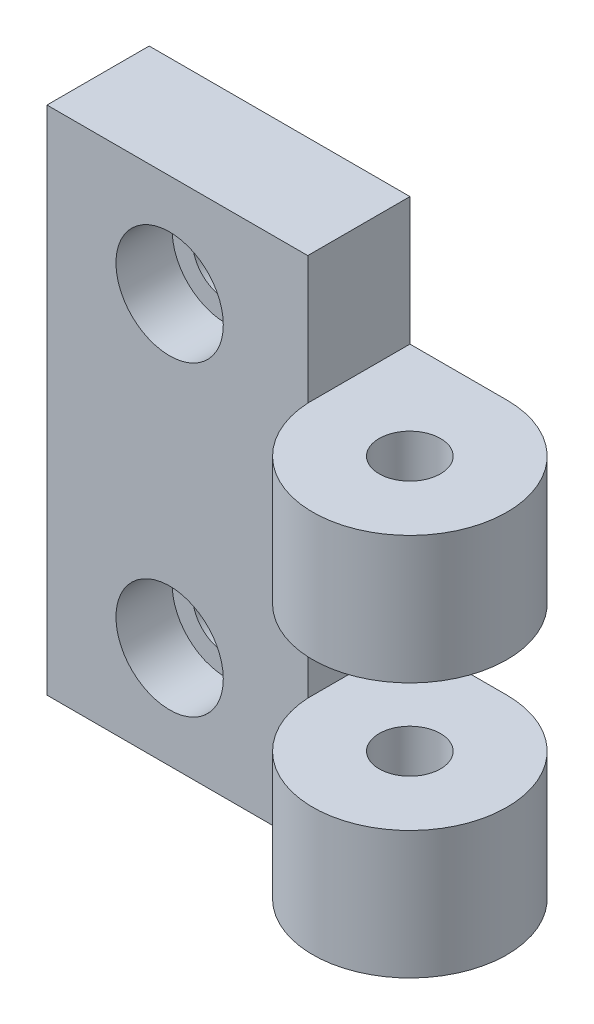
ISO-10303-21;
HEADER;
FILE_DESCRIPTION(('STEP AP214'),'2;1');
FILE_NAME('part.step','',(''),(''),'','','');
FILE_SCHEMA(('AUTOMOTIVE_DESIGN { 1 0 10303 214 1 1 1 1 }'));
ENDSEC;
DATA;
#1=APPLICATION_CONTEXT('core data for automotive mechanical design processes');
#2=APPLICATION_PROTOCOL_DEFINITION('international standard','automotive_design',2000,#1);
#3=PRODUCT_CONTEXT('',#1,'mechanical');
#4=PRODUCT('Part','Part','',(#3));
#5=PRODUCT_RELATED_PRODUCT_CATEGORY('part','',(#4));
#6=PRODUCT_DEFINITION_FORMATION('','',#4);
#7=PRODUCT_DEFINITION_CONTEXT('part definition',#1,'design');
#8=PRODUCT_DEFINITION('design','',#6,#7);
#9=PRODUCT_DEFINITION_SHAPE('','',#8);
#10=(LENGTH_UNIT() NAMED_UNIT(*) SI_UNIT(.MILLI.,.METRE.));
#11=(NAMED_UNIT(*) PLANE_ANGLE_UNIT() SI_UNIT($,.RADIAN.));
#12=(NAMED_UNIT(*) SI_UNIT($,.STERADIAN.) SOLID_ANGLE_UNIT());
#13=UNCERTAINTY_MEASURE_WITH_UNIT(LENGTH_MEASURE(1.E-05),#10,'distance_accuracy_value','');
#14=(GEOMETRIC_REPRESENTATION_CONTEXT(3) GLOBAL_UNCERTAINTY_ASSIGNED_CONTEXT((#13)) GLOBAL_UNIT_ASSIGNED_CONTEXT((#10,
#11,#12)) REPRESENTATION_CONTEXT('',''));
#15=CARTESIAN_POINT('',(0.,0.,0.));
#16=DIRECTION('',(0.,0.,1.));
#17=DIRECTION('',(1.,0.,0.));
#18=AXIS2_PLACEMENT_3D('',#15,#16,#17);
#19=CARTESIAN_POINT('',(35.0000000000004,50.,-0.499999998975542));
#20=DIRECTION('',(0.,-1.,0.));
#21=DIRECTION('',(0.,0.,-1.00000000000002));
#22=AXIS2_PLACEMENT_3D('',#19,#20,#21);
#23=CYLINDRICAL_SURFACE('',#22,9.5);
#24=CARTESIAN_POINT('',(34.9999999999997,12.5,-0.499999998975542));
#25=DIRECTION('',(0.,-1.,0.));
#26=DIRECTION('',(1.00000000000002,0.,0.));
#27=AXIS2_PLACEMENT_3D('',#24,#25,#26);
#28=CIRCLE('',#27,9.5);
#29=CARTESIAN_POINT('',(34.9999999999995,12.5,-9.9999999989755));
#30=VERTEX_POINT('',#29);
#31=CARTESIAN_POINT('',(25.5131670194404,12.5,1.11022302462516E-13));
#32=VERTEX_POINT('',#31);
#33=EDGE_CURVE('E136',#30,#32,#28,.T.);
#34=ORIENTED_EDGE('',*,*,#33,.T.);
#35=DIRECTION('',(0.,-1.,0.));
#36=VECTOR('',#35,1.);
#37=CARTESIAN_POINT('',(25.5131670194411,49.9999999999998,-1.11022302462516E-13));
#38=LINE('',#37,#36);
#39=CARTESIAN_POINT('',(25.5131670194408,-2.22044604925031E-13,0.));
#40=VERTEX_POINT('',#39);
#41=EDGE_CURVE('E133',#32,#40,#38,.T.);
#42=ORIENTED_EDGE('',*,*,#41,.T.);
#43=CARTESIAN_POINT('',(34.9999999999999,-2.22044604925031E-13,-0.499999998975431));
#44=DIRECTION('',(0.,1.,0.));
#45=DIRECTION('',(0.,0.,1.00000000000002));
#46=AXIS2_PLACEMENT_3D('',#43,#44,#45);
#47=CIRCLE('',#46,9.5);
#48=CARTESIAN_POINT('',(34.9999999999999,-2.22044604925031E-13,-9.99999999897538));
#49=VERTEX_POINT('',#48);
#50=EDGE_CURVE('E200',#40,#49,#47,.T.);
#51=ORIENTED_EDGE('',*,*,#50,.T.);
#52=DIRECTION('',(0.,-1.,0.));
#53=VECTOR('',#52,1.);
#54=CARTESIAN_POINT('',(35.0000000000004,50.,-9.9999999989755));
#55=LINE('',#54,#53);
#56=EDGE_CURVE('E219',#30,#49,#55,.T.);
#57=ORIENTED_EDGE('',*,*,#56,.F.);
#58=EDGE_LOOP('',(#34,#42,#51,#57));
#59=FACE_BOUND('',#58,.T.);
#60=ADVANCED_FACE('F36',(#59),#23,.T.);
#61=CARTESIAN_POINT('',(35.0000000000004,50.,-0.499999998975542));
#62=DIRECTION('',(0.,-1.,0.));
#63=DIRECTION('',(0.,0.,-1.00000000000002));
#64=AXIS2_PLACEMENT_3D('',#61,#62,#63);
#65=CYLINDRICAL_SURFACE('',#64,3.);
#66=CARTESIAN_POINT('',(34.9999999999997,12.5,-0.499999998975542));
#67=DIRECTION('',(0.,-1.,0.));
#68=DIRECTION('',(1.00000000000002,0.,0.));
#69=AXIS2_PLACEMENT_3D('',#66,#67,#68);
#70=CIRCLE('',#69,3.);
#71=CARTESIAN_POINT('',(37.9999999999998,12.5,-0.499999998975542));
#72=VERTEX_POINT('',#71);
#73=EDGE_CURVE('E113',#72,#72,#70,.T.);
#74=ORIENTED_EDGE('',*,*,#73,.F.);
#75=EDGE_LOOP('',(#74));
#76=FACE_BOUND('',#75,.T.);
#77=CARTESIAN_POINT('',(34.9999999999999,-2.22044604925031E-13,-0.499999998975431));
#78=DIRECTION('',(0.,1.,0.));
#79=DIRECTION('',(0.,0.,1.00000000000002));
#80=AXIS2_PLACEMENT_3D('',#77,#78,#79);
#81=CIRCLE('',#80,3.);
#82=CARTESIAN_POINT('',(34.9999999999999,-2.22044604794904E-13,2.50000000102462));
#83=VERTEX_POINT('',#82);
#84=EDGE_CURVE('E189',#83,#83,#81,.T.);
#85=ORIENTED_EDGE('',*,*,#84,.F.);
#86=EDGE_LOOP('',(#85));
#87=FACE_BOUND('',#86,.T.);
#88=ADVANCED_FACE('F245',(#76,#87),#65,.F.);
#89=CARTESIAN_POINT('',(35.0000000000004,50.,-0.499999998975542));
#90=DIRECTION('',(0.,1.,0.));
#91=DIRECTION('',(0.,0.,1.00000000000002));
#92=AXIS2_PLACEMENT_3D('',#89,#90,#91);
#93=PLANE('',#92);
#94=DIRECTION('',(0.,0.,1.00000000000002));
#95=VECTOR('',#94,1.);
#96=CARTESIAN_POINT('',(25.5131670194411,49.9999999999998,-25.0000000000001));
#97=LINE('',#96,#95);
#98=CARTESIAN_POINT('',(25.5131670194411,49.9999999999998,-9.9999999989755));
#99=VERTEX_POINT('',#98);
#100=CARTESIAN_POINT('',(25.5131670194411,49.9999999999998,-1.11022302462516E-13));
#101=VERTEX_POINT('',#100);
#102=EDGE_CURVE('E135',#99,#101,#97,.T.);
#103=ORIENTED_EDGE('',*,*,#102,.F.);
#104=DIRECTION('',(-1.00000000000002,0.,0.));
#105=VECTOR('',#104,1.);
#106=CARTESIAN_POINT('',(2.22044604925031E-13,50.,-9.9999999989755));
#107=LINE('',#106,#105);
#108=CARTESIAN_POINT('',(2.22044604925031E-13,50.,-9.9999999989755));
#109=VERTEX_POINT('',#108);
#110=EDGE_CURVE('E214',#99,#109,#107,.T.);
#111=ORIENTED_EDGE('',*,*,#110,.T.);
#112=DIRECTION('',(0.,0.,1.00000000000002));
#113=VECTOR('',#112,1.);
#114=CARTESIAN_POINT('',(2.22044604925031E-13,50.,-1.11022302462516E-13));
#115=LINE('',#114,#113);
#116=CARTESIAN_POINT('',(2.22044604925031E-13,50.,-1.11022302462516E-13));
#117=VERTEX_POINT('',#116);
#118=EDGE_CURVE('E206',#109,#117,#115,.T.);
#119=ORIENTED_EDGE('',*,*,#118,.T.);
#120=DIRECTION('',(1.00000000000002,0.,0.));
#121=VECTOR('',#120,1.);
#122=CARTESIAN_POINT('',(2.22044604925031E-13,50.,-1.11022302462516E-13));
#123=LINE('',#122,#121);
#124=EDGE_CURVE('E210',#117,#101,#123,.T.);
#125=ORIENTED_EDGE('',*,*,#124,.T.);
#126=EDGE_LOOP('',(#103,#111,#119,#125));
#127=FACE_BOUND('',#126,.T.);
#128=ADVANCED_FACE('F251',(#127),#93,.T.);
#129=CARTESIAN_POINT('',(34.9999999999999,-2.22044604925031E-13,-0.499999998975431));
#130=DIRECTION('',(0.,1.,0.));
#131=DIRECTION('',(0.,0.,1.00000000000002));
#132=AXIS2_PLACEMENT_3D('',#129,#130,#131);
#133=PLANE('',#132);
#134=DIRECTION('',(0.,0.,1.00000000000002));
#135=VECTOR('',#134,1.);
#136=CARTESIAN_POINT('',(0.,0.,0.));
#137=LINE('',#136,#135);
#138=CARTESIAN_POINT('',(0.,0.,-9.99999999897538));
#139=VERTEX_POINT('',#138);
#140=CARTESIAN_POINT('',(0.,0.,0.));
#141=VERTEX_POINT('',#140);
#142=EDGE_CURVE('E193',#139,#141,#137,.T.);
#143=ORIENTED_EDGE('',*,*,#142,.F.);
#144=DIRECTION('',(-1.00000000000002,0.,0.));
#145=VECTOR('',#144,1.);
#146=CARTESIAN_POINT('',(0.,0.,-9.99999999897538));
#147=LINE('',#146,#145);
#148=EDGE_CURVE('E204',#49,#139,#147,.T.);
#149=ORIENTED_EDGE('',*,*,#148,.F.);
#150=ORIENTED_EDGE('',*,*,#50,.F.);
#151=DIRECTION('',(1.00000000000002,0.,0.));
#152=VECTOR('',#151,1.);
#153=CARTESIAN_POINT('',(0.,0.,0.));
#154=LINE('',#153,#152);
#155=EDGE_CURVE('E197',#141,#40,#154,.T.);
#156=ORIENTED_EDGE('',*,*,#155,.F.);
#157=EDGE_LOOP('',(#143,#149,#150,#156));
#158=FACE_BOUND('',#157,.T.);
#159=ORIENTED_EDGE('',*,*,#84,.T.);
#160=EDGE_LOOP('',(#159));
#161=FACE_BOUND('',#160,.T.);
#162=ADVANCED_FACE('F265',(#158,#161),#133,.F.);
#163=CARTESIAN_POINT('',(2.22044604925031E-13,50.,-1.11022302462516E-13));
#164=DIRECTION('',(1.00000000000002,0.,0.));
#165=DIRECTION('',(0.,0.,-1.00000000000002));
#166=AXIS2_PLACEMENT_3D('',#163,#164,#165);
#167=PLANE('',#166);
#168=ORIENTED_EDGE('',*,*,#142,.T.);
#169=DIRECTION('',(0.,-1.,0.));
#170=VECTOR('',#169,1.);
#171=CARTESIAN_POINT('',(2.22044604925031E-13,50.,-1.11022302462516E-13));
#172=LINE('',#171,#170);
#173=EDGE_CURVE('E146',#117,#141,#172,.T.);
#174=ORIENTED_EDGE('',*,*,#173,.F.);
#175=ORIENTED_EDGE('',*,*,#118,.F.);
#176=DIRECTION('',(0.,-1.,0.));
#177=VECTOR('',#176,1.);
#178=CARTESIAN_POINT('',(2.22044604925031E-13,50.,-9.9999999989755));
#179=LINE('',#178,#177);
#180=EDGE_CURVE('E216',#109,#139,#179,.T.);
#181=ORIENTED_EDGE('',*,*,#180,.T.);
#182=EDGE_LOOP('',(#168,#174,#175,#181));
#183=FACE_BOUND('',#182,.T.);
#184=ADVANCED_FACE('F38',(#183),#167,.F.);
#185=CARTESIAN_POINT('',(2.22044604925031E-13,50.,-1.11022302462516E-13));
#186=DIRECTION('',(0.,0.,-1.00000000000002));
#187=DIRECTION('',(-1.00000000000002,0.,0.));
#188=AXIS2_PLACEMENT_3D('',#185,#186,#187);
#189=PLANE('',#188);
#190=CARTESIAN_POINT('',(12.,39.9999999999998,-1.11022302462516E-13));
#191=DIRECTION('',(0.,0.,1.00000000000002));
#192=DIRECTION('',(1.00000000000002,0.,0.));
#193=AXIS2_PLACEMENT_3D('',#190,#191,#192);
#194=CIRCLE('',#193,5.24999999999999);
#195=CARTESIAN_POINT('',(17.2500000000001,39.9999999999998,-1.11022302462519E-13));
#196=VERTEX_POINT('',#195);
#197=EDGE_CURVE('E269',#196,#196,#194,.T.);
#198=ORIENTED_EDGE('',*,*,#197,.F.);
#199=EDGE_LOOP('',(#198));
#200=FACE_BOUND('',#199,.T.);
#201=CARTESIAN_POINT('',(11.9999999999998,10.,0.));
#202=DIRECTION('',(0.,0.,1.00000000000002));
#203=DIRECTION('',(1.00000000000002,0.,0.));
#204=AXIS2_PLACEMENT_3D('',#201,#202,#203);
#205=CIRCLE('',#204,5.24999999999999);
#206=CARTESIAN_POINT('',(17.2499999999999,10.,0.));
#207=VERTEX_POINT('',#206);
#208=EDGE_CURVE('E272',#207,#207,#205,.T.);
#209=ORIENTED_EDGE('',*,*,#208,.F.);
#210=EDGE_LOOP('',(#209));
#211=FACE_BOUND('',#210,.T.);
#212=ORIENTED_EDGE('',*,*,#155,.T.);
#213=ORIENTED_EDGE('',*,*,#41,.F.);
#214=DIRECTION('',(0.,-1.,0.));
#215=VECTOR('',#214,1.);
#216=CARTESIAN_POINT('',(25.5131670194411,49.9999999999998,0.));
#217=LINE('',#216,#215);
#218=CARTESIAN_POINT('',(25.5131670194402,24.9999999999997,0.));
#219=VERTEX_POINT('',#218);
#220=EDGE_CURVE('E120',#32,#219,#217,.F.);
#221=ORIENTED_EDGE('',*,*,#220,.T.);
#222=CARTESIAN_POINT('',(25.5131670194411,37.4999999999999,-1.11022302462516E-13));
#223=VERTEX_POINT('',#222);
#224=EDGE_CURVE('E132',#223,#219,#38,.T.);
#225=ORIENTED_EDGE('',*,*,#224,.F.);
#226=EDGE_CURVE('E141',#101,#223,#38,.T.);
#227=ORIENTED_EDGE('',*,*,#226,.F.);
#228=ORIENTED_EDGE('',*,*,#124,.F.);
#229=ORIENTED_EDGE('',*,*,#173,.T.);
#230=EDGE_LOOP('',(#212,#213,#221,#225,#227,#228,#229));
#231=FACE_BOUND('',#230,.T.);
#232=ADVANCED_FACE('F130',(#200,#211,#231),#189,.F.);
#233=ORIENTED_EDGE('',*,*,#224,.T.);
#234=CARTESIAN_POINT('',(34.9999999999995,24.9999999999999,-0.499999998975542));
#235=DIRECTION('',(0.,1.,0.));
#236=DIRECTION('',(-1.00000000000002,0.,0.));
#237=AXIS2_PLACEMENT_3D('',#234,#235,#236);
#238=CIRCLE('',#237,9.5);
#239=CARTESIAN_POINT('',(34.9999999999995,24.9999999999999,-9.9999999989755));
#240=VERTEX_POINT('',#239);
#241=EDGE_CURVE('E104',#219,#240,#238,.T.);
#242=ORIENTED_EDGE('',*,*,#241,.T.);
#243=CARTESIAN_POINT('',(35.0000000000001,37.4999999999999,-9.9999999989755));
#244=VERTEX_POINT('',#243);
#245=EDGE_CURVE('E148',#244,#240,#55,.T.);
#246=ORIENTED_EDGE('',*,*,#245,.F.);
#247=CARTESIAN_POINT('',(35.0000000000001,37.4999999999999,-0.499999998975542));
#248=DIRECTION('',(0.,-1.,0.));
#249=DIRECTION('',(0.,0.,-1.00000000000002));
#250=AXIS2_PLACEMENT_3D('',#247,#248,#249);
#251=CIRCLE('',#250,9.5);
#252=EDGE_CURVE('E139',#244,#223,#251,.T.);
#253=ORIENTED_EDGE('',*,*,#252,.T.);
#254=EDGE_LOOP('',(#233,#242,#246,#253));
#255=FACE_BOUND('',#254,.T.);
#256=ADVANCED_FACE('F138',(#255),#23,.T.);
#257=CARTESIAN_POINT('',(2.22044604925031E-13,50.,-9.9999999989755));
#258=DIRECTION('',(0.,0.,1.00000000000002));
#259=DIRECTION('',(1.00000000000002,0.,0.));
#260=AXIS2_PLACEMENT_3D('',#257,#258,#259);
#261=PLANE('',#260);
#262=CARTESIAN_POINT('',(12.,39.9999999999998,-9.9999999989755));
#263=DIRECTION('',(0.,0.,1.00000000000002));
#264=DIRECTION('',(1.00000000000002,0.,0.));
#265=AXIS2_PLACEMENT_3D('',#262,#263,#264);
#266=CIRCLE('',#265,3.25);
#267=CARTESIAN_POINT('',(15.2500000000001,39.9999999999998,-9.9999999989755));
#268=VERTEX_POINT('',#267);
#269=EDGE_CURVE('E276',#268,#268,#266,.T.);
#270=ORIENTED_EDGE('',*,*,#269,.T.);
#271=EDGE_LOOP('',(#270));
#272=FACE_BOUND('',#271,.T.);
#273=CARTESIAN_POINT('',(11.9999999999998,10.,-9.99999999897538));
#274=DIRECTION('',(0.,0.,1.00000000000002));
#275=DIRECTION('',(1.00000000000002,0.,0.));
#276=AXIS2_PLACEMENT_3D('',#273,#274,#275);
#277=CIRCLE('',#276,3.25);
#278=CARTESIAN_POINT('',(15.2499999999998,10.,-9.99999999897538));
#279=VERTEX_POINT('',#278);
#280=EDGE_CURVE('E124',#279,#279,#277,.T.);
#281=ORIENTED_EDGE('',*,*,#280,.T.);
#282=EDGE_LOOP('',(#281));
#283=FACE_BOUND('',#282,.T.);
#284=DIRECTION('',(0.,-1.,0.));
#285=VECTOR('',#284,1.);
#286=CARTESIAN_POINT('',(25.5131670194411,49.9999999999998,-9.9999999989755));
#287=LINE('',#286,#285);
#288=CARTESIAN_POINT('',(25.5131670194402,24.9999999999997,-9.9999999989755));
#289=VERTEX_POINT('',#288);
#290=CARTESIAN_POINT('',(25.5131670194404,12.5,-9.99999999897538));
#291=VERTEX_POINT('',#290);
#292=EDGE_CURVE('E11',#289,#291,#287,.T.);
#293=ORIENTED_EDGE('',*,*,#292,.T.);
#294=DIRECTION('',(1.00000000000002,0.,0.));
#295=VECTOR('',#294,1.);
#296=CARTESIAN_POINT('',(-4.44089209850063E-13,12.5,-9.99999999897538));
#297=LINE('',#296,#295);
#298=EDGE_CURVE('E168',#291,#30,#297,.T.);
#299=ORIENTED_EDGE('',*,*,#298,.T.);
#300=ORIENTED_EDGE('',*,*,#56,.T.);
#301=ORIENTED_EDGE('',*,*,#148,.T.);
#302=ORIENTED_EDGE('',*,*,#180,.F.);
#303=ORIENTED_EDGE('',*,*,#110,.F.);
#304=DIRECTION('',(0.,-1.,0.));
#305=VECTOR('',#304,1.);
#306=CARTESIAN_POINT('',(25.5131670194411,49.9999999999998,-9.9999999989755));
#307=LINE('',#306,#305);
#308=CARTESIAN_POINT('',(25.5131670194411,37.4999999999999,-9.9999999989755));
#309=VERTEX_POINT('',#308);
#310=EDGE_CURVE('E45',#99,#309,#307,.T.);
#311=ORIENTED_EDGE('',*,*,#310,.T.);
#312=DIRECTION('',(1.00000000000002,0.,0.));
#313=VECTOR('',#312,1.);
#314=CARTESIAN_POINT('',(-2.22044604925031E-13,37.4999999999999,-9.99999999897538));
#315=LINE('',#314,#313);
#316=EDGE_CURVE('E159',#309,#244,#315,.T.);
#317=ORIENTED_EDGE('',*,*,#316,.T.);
#318=ORIENTED_EDGE('',*,*,#245,.T.);
#319=DIRECTION('',(-1.00000000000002,0.,0.));
#320=VECTOR('',#319,1.);
#321=CARTESIAN_POINT('',(-6.66133814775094E-13,25.0000000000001,-9.99999999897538));
#322=LINE('',#321,#320);
#323=EDGE_CURVE('E107',#240,#289,#322,.T.);
#324=ORIENTED_EDGE('',*,*,#323,.T.);
#325=EDGE_LOOP('',(#293,#299,#300,#301,#302,#303,#311,#317,#318,#324));
#326=FACE_BOUND('',#325,.T.);
#327=ADVANCED_FACE('F227',(#272,#283,#326),#261,.F.);
#328=CARTESIAN_POINT('',(34.9999999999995,24.9999999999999,-0.499999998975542));
#329=DIRECTION('',(0.,1.,0.));
#330=DIRECTION('',(-1.00000000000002,0.,0.));
#331=AXIS2_PLACEMENT_3D('',#328,#329,#330);
#332=CIRCLE('',#331,3.);
#333=CARTESIAN_POINT('',(31.9999999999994,24.9999999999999,-0.499999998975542));
#334=VERTEX_POINT('',#333);
#335=EDGE_CURVE('E163',#334,#334,#332,.T.);
#336=ORIENTED_EDGE('',*,*,#335,.F.);
#337=EDGE_LOOP('',(#336));
#338=FACE_BOUND('',#337,.T.);
#339=CARTESIAN_POINT('',(35.0000000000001,37.4999999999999,-0.499999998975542));
#340=DIRECTION('',(0.,-1.,0.));
#341=DIRECTION('',(0.,0.,-1.00000000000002));
#342=AXIS2_PLACEMENT_3D('',#339,#340,#341);
#343=CIRCLE('',#342,3.);
#344=CARTESIAN_POINT('',(35.0000000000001,37.4999999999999,-3.49999999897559));
#345=VERTEX_POINT('',#344);
#346=EDGE_CURVE('E155',#345,#345,#343,.T.);
#347=ORIENTED_EDGE('',*,*,#346,.F.);
#348=EDGE_LOOP('',(#347));
#349=FACE_BOUND('',#348,.T.);
#350=ADVANCED_FACE('F241',(#338,#349),#65,.F.);
#351=CARTESIAN_POINT('',(25.5131670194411,49.9999999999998,-25.0000000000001));
#352=DIRECTION('',(-1.00000000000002,0.,0.));
#353=DIRECTION('',(0.,0.,1.00000000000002));
#354=AXIS2_PLACEMENT_3D('',#351,#352,#353);
#355=PLANE('',#354);
#356=DIRECTION('',(0.,0.,1.00000000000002));
#357=VECTOR('',#356,1.);
#358=CARTESIAN_POINT('',(25.5131670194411,37.4999999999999,-25.0000000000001));
#359=LINE('',#358,#357);
#360=EDGE_CURVE('E60',#309,#223,#359,.T.);
#361=ORIENTED_EDGE('',*,*,#360,.F.);
#362=ORIENTED_EDGE('',*,*,#310,.F.);
#363=ORIENTED_EDGE('',*,*,#102,.T.);
#364=ORIENTED_EDGE('',*,*,#226,.T.);
#365=EDGE_LOOP('',(#361,#362,#363,#364));
#366=FACE_BOUND('',#365,.T.);
#367=ADVANCED_FACE('F232',(#366),#355,.F.);
#368=CARTESIAN_POINT('',(44.5000000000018,37.4999999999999,-25.0000000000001));
#369=DIRECTION('',(0.,-1.,0.));
#370=DIRECTION('',(0.,0.,-1.00000000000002));
#371=AXIS2_PLACEMENT_3D('',#368,#369,#370);
#372=PLANE('',#371);
#373=ORIENTED_EDGE('',*,*,#346,.T.);
#374=EDGE_LOOP('',(#373));
#375=FACE_BOUND('',#374,.T.);
#376=ORIENTED_EDGE('',*,*,#252,.F.);
#377=ORIENTED_EDGE('',*,*,#316,.F.);
#378=ORIENTED_EDGE('',*,*,#360,.T.);
#379=EDGE_LOOP('',(#376,#377,#378));
#380=FACE_BOUND('',#379,.T.);
#381=ADVANCED_FACE('F230',(#375,#380),#372,.F.);
#382=CARTESIAN_POINT('',(25.5131670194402,24.9999999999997,-25.0000000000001));
#383=DIRECTION('',(-1.00000000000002,0.,0.));
#384=DIRECTION('',(0.,0.,1.00000000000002));
#385=AXIS2_PLACEMENT_3D('',#382,#383,#384);
#386=PLANE('',#385);
#387=DIRECTION('',(0.,0.,1.00000000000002));
#388=VECTOR('',#387,1.);
#389=CARTESIAN_POINT('',(25.5131670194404,12.5,-25.));
#390=LINE('',#389,#388);
#391=EDGE_CURVE('E123',#291,#32,#390,.T.);
#392=ORIENTED_EDGE('',*,*,#391,.F.);
#393=ORIENTED_EDGE('',*,*,#292,.F.);
#394=DIRECTION('',(0.,0.,1.00000000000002));
#395=VECTOR('',#394,1.);
#396=CARTESIAN_POINT('',(25.5131670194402,24.9999999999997,-25.0000000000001));
#397=LINE('',#396,#395);
#398=EDGE_CURVE('E52',#289,#219,#397,.T.);
#399=ORIENTED_EDGE('',*,*,#398,.T.);
#400=ORIENTED_EDGE('',*,*,#220,.F.);
#401=EDGE_LOOP('',(#392,#393,#399,#400));
#402=FACE_BOUND('',#401,.T.);
#403=ADVANCED_FACE('F119',(#402),#386,.F.);
#404=CARTESIAN_POINT('',(44.5000000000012,12.5,-25.0000000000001));
#405=DIRECTION('',(0.,-1.,0.));
#406=DIRECTION('',(1.00000000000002,0.,0.));
#407=AXIS2_PLACEMENT_3D('',#404,#405,#406);
#408=PLANE('',#407);
#409=ORIENTED_EDGE('',*,*,#73,.T.);
#410=EDGE_LOOP('',(#409));
#411=FACE_BOUND('',#410,.T.);
#412=ORIENTED_EDGE('',*,*,#33,.F.);
#413=ORIENTED_EDGE('',*,*,#298,.F.);
#414=ORIENTED_EDGE('',*,*,#391,.T.);
#415=EDGE_LOOP('',(#412,#413,#414));
#416=FACE_BOUND('',#415,.T.);
#417=ADVANCED_FACE('F239',(#411,#416),#408,.F.);
#418=CARTESIAN_POINT('',(44.5000000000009,25.0000000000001,-25.0000000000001));
#419=DIRECTION('',(0.,1.,0.));
#420=DIRECTION('',(-1.00000000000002,0.,0.));
#421=AXIS2_PLACEMENT_3D('',#418,#419,#420);
#422=PLANE('',#421);
#423=ORIENTED_EDGE('',*,*,#335,.T.);
#424=EDGE_LOOP('',(#423));
#425=FACE_BOUND('',#424,.T.);
#426=ORIENTED_EDGE('',*,*,#398,.F.);
#427=ORIENTED_EDGE('',*,*,#323,.F.);
#428=ORIENTED_EDGE('',*,*,#241,.F.);
#429=EDGE_LOOP('',(#426,#427,#428));
#430=FACE_BOUND('',#429,.T.);
#431=ADVANCED_FACE('F105',(#425,#430),#422,.F.);
#432=CARTESIAN_POINT('',(11.9999999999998,10.,0.));
#433=DIRECTION('',(0.,0.,1.00000000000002));
#434=DIRECTION('',(1.00000000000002,0.,0.));
#435=AXIS2_PLACEMENT_3D('',#432,#433,#434);
#436=CYLINDRICAL_SURFACE('',#435,3.25);
#437=ORIENTED_EDGE('',*,*,#280,.F.);
#438=EDGE_LOOP('',(#437));
#439=FACE_BOUND('',#438,.T.);
#440=CARTESIAN_POINT('',(11.9999999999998,10.,-5.49999999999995));
#441=DIRECTION('',(0.,0.,1.00000000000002));
#442=DIRECTION('',(1.00000000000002,0.,0.));
#443=AXIS2_PLACEMENT_3D('',#440,#441,#442);
#444=CIRCLE('',#443,3.25);
#445=CARTESIAN_POINT('',(15.2499999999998,10.,-5.49999999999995));
#446=VERTEX_POINT('',#445);
#447=EDGE_CURVE('E280',#446,#446,#444,.T.);
#448=ORIENTED_EDGE('',*,*,#447,.T.);
#449=EDGE_LOOP('',(#448));
#450=FACE_BOUND('',#449,.T.);
#451=ADVANCED_FACE('F328',(#439,#450),#436,.F.);
#452=CARTESIAN_POINT('',(15.2499999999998,9.99999999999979,-5.49999999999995));
#453=DIRECTION('',(0.,0.,-1.00000000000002));
#454=DIRECTION('',(-1.00000000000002,0.,0.));
#455=AXIS2_PLACEMENT_3D('',#452,#453,#454);
#456=PLANE('',#455);
#457=ORIENTED_EDGE('',*,*,#447,.F.);
#458=EDGE_LOOP('',(#457));
#459=FACE_BOUND('',#458,.T.);
#460=CARTESIAN_POINT('',(11.9999999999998,10.,-5.49999999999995));
#461=DIRECTION('',(0.,0.,1.00000000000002));
#462=DIRECTION('',(1.00000000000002,0.,0.));
#463=AXIS2_PLACEMENT_3D('',#460,#461,#462);
#464=CIRCLE('',#463,5.25);
#465=CARTESIAN_POINT('',(17.2499999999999,10.,-5.49999999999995));
#466=VERTEX_POINT('',#465);
#467=EDGE_CURVE('E275',#466,#466,#464,.T.);
#468=ORIENTED_EDGE('',*,*,#467,.T.);
#469=EDGE_LOOP('',(#468));
#470=FACE_BOUND('',#469,.T.);
#471=ADVANCED_FACE('F324',(#459,#470),#456,.F.);
#472=CARTESIAN_POINT('',(11.9999999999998,10.,0.));
#473=DIRECTION('',(0.,0.,1.00000000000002));
#474=DIRECTION('',(1.00000000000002,0.,0.));
#475=AXIS2_PLACEMENT_3D('',#472,#473,#474);
#476=CYLINDRICAL_SURFACE('',#475,5.25);
#477=ORIENTED_EDGE('',*,*,#467,.F.);
#478=EDGE_LOOP('',(#477));
#479=FACE_BOUND('',#478,.T.);
#480=ORIENTED_EDGE('',*,*,#208,.T.);
#481=EDGE_LOOP('',(#480));
#482=FACE_BOUND('',#481,.T.);
#483=ADVANCED_FACE('F320',(#479,#482),#476,.F.);
#484=CARTESIAN_POINT('',(12.,39.9999999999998,-1.11022302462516E-13));
#485=DIRECTION('',(0.,0.,1.00000000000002));
#486=DIRECTION('',(1.00000000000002,0.,0.));
#487=AXIS2_PLACEMENT_3D('',#484,#485,#486);
#488=CYLINDRICAL_SURFACE('',#487,3.25);
#489=ORIENTED_EDGE('',*,*,#269,.F.);
#490=EDGE_LOOP('',(#489));
#491=FACE_BOUND('',#490,.T.);
#492=CARTESIAN_POINT('',(12.,39.9999999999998,-5.50000000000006));
#493=DIRECTION('',(0.,0.,1.00000000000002));
#494=DIRECTION('',(1.00000000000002,0.,0.));
#495=AXIS2_PLACEMENT_3D('',#492,#493,#494);
#496=CIRCLE('',#495,3.25);
#497=CARTESIAN_POINT('',(15.2500000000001,39.9999999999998,-5.50000000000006));
#498=VERTEX_POINT('',#497);
#499=EDGE_CURVE('E284',#498,#498,#496,.T.);
#500=ORIENTED_EDGE('',*,*,#499,.T.);
#501=EDGE_LOOP('',(#500));
#502=FACE_BOUND('',#501,.T.);
#503=ADVANCED_FACE('F313',(#491,#502),#488,.F.);
#504=CARTESIAN_POINT('',(15.25,39.9999999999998,-5.50000000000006));
#505=DIRECTION('',(0.,0.,-1.00000000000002));
#506=DIRECTION('',(-1.00000000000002,0.,0.));
#507=AXIS2_PLACEMENT_3D('',#504,#505,#506);
#508=PLANE('',#507);
#509=ORIENTED_EDGE('',*,*,#499,.F.);
#510=EDGE_LOOP('',(#509));
#511=FACE_BOUND('',#510,.T.);
#512=CARTESIAN_POINT('',(12.,39.9999999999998,-5.50000000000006));
#513=DIRECTION('',(0.,0.,1.00000000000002));
#514=DIRECTION('',(1.00000000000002,0.,0.));
#515=AXIS2_PLACEMENT_3D('',#512,#513,#514);
#516=CIRCLE('',#515,5.25);
#517=CARTESIAN_POINT('',(17.2500000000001,39.9999999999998,-5.50000000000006));
#518=VERTEX_POINT('',#517);
#519=EDGE_CURVE('E296',#518,#518,#516,.T.);
#520=ORIENTED_EDGE('',*,*,#519,.T.);
#521=EDGE_LOOP('',(#520));
#522=FACE_BOUND('',#521,.T.);
#523=ADVANCED_FACE('F307',(#511,#522),#508,.F.);
#524=CARTESIAN_POINT('',(12.,39.9999999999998,-1.11022302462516E-13));
#525=DIRECTION('',(0.,0.,1.00000000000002));
#526=DIRECTION('',(1.00000000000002,0.,0.));
#527=AXIS2_PLACEMENT_3D('',#524,#525,#526);
#528=CYLINDRICAL_SURFACE('',#527,5.25);
#529=ORIENTED_EDGE('',*,*,#519,.F.);
#530=EDGE_LOOP('',(#529));
#531=FACE_BOUND('',#530,.T.);
#532=ORIENTED_EDGE('',*,*,#197,.T.);
#533=EDGE_LOOP('',(#532));
#534=FACE_BOUND('',#533,.T.);
#535=ADVANCED_FACE('F305',(#531,#534),#528,.F.);
#536=CLOSED_SHELL('',(#60,#88,#128,#162,#184,#232,#256,#327,#350,#367,#381,#403,#417,#431,#451,
#471,#483,#503,#523,#535));
#537=MANIFOLD_SOLID_BREP('B2',#536);
#538=ADVANCED_BREP_SHAPE_REPRESENTATION('',(#18,#537),#14);
#539=SHAPE_DEFINITION_REPRESENTATION(#9,#538);
ENDSEC;
END-ISO-10303-21;
